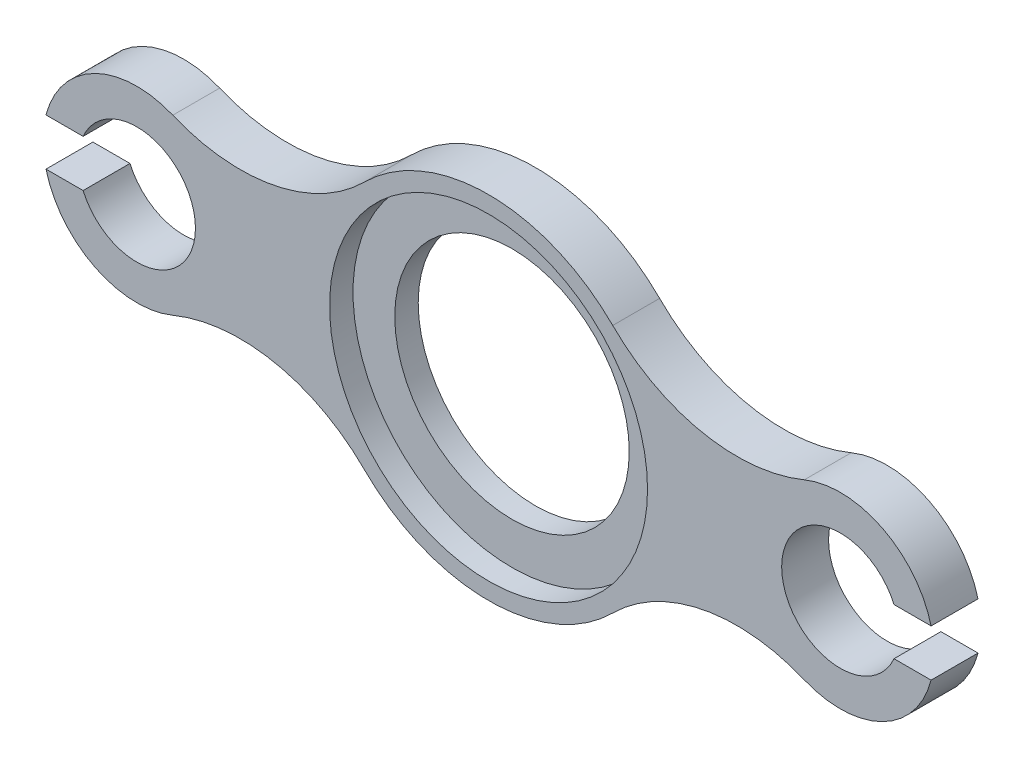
from build123d import *

# Parameters (mm, degrees)
ESQUISSE1_R             = 50
BOSS_EXTRU_1_DEPTH      = 20
ESQUISSE2_R             = 67.8
ENL_V_MAT_EXTRU_1_DEPTH = 10


with BuildPart() as part:
    # Esquisse1 → Boss.-Extru.1 (new body)
    with BuildSketch(Plane.XY):
        with BuildLine():
            Line((172.912878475, -10), (188.729833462, -10))
            ThreePointArc((188.729833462, -10), (167.842344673, -35.800149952), (134.666666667, -36.944402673))
            ThreePointArc((134.666666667, -36.944402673), (91.362529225, -32.640861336), (52.958333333, -53.107578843))
            ThreePointArc((52.958333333, -53.107578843), (0, -75), (-52.958333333, -53.107578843))
            ThreePointArc((-52.958333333, -53.107578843), (-91.362529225, -32.640861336), (-134.666666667, -36.944402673))
            ThreePointArc((-134.666666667, -36.944402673), (-167.842344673, -35.800149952), (-188.729833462, -10))
            Line((-188.729833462, -10), (-172.912878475, -10))
            ThreePointArc((-172.912878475, -10), (-125, 0), (-172.912878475, 10))
            Line((-172.912878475, 10), (-188.729833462, 10))
            ThreePointArc((-188.729833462, 10), (-167.842344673, 35.800149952), (-134.666666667, 36.944402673))
            ThreePointArc((-134.666666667, 36.944402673), (-91.362529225, 32.640861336), (-52.958333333, 53.107578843))
            ThreePointArc((-52.958333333, 53.107578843), (0, 75), (52.958333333, 53.107578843))
            ThreePointArc((52.958333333, 53.107578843), (91.362529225, 32.640861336), (134.666666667, 36.944402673))
            ThreePointArc((134.666666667, 36.944402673), (167.842344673, 35.800149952), (188.729833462, 10))
            Line((188.729833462, 10), (172.912878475, 10))
            ThreePointArc((172.912878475, 10), (125, 0), (172.912878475, -10))
        make_face()
        Circle(ESQUISSE1_R, mode=Mode.SUBTRACT)
    extrude(amount=BOSS_EXTRU_1_DEPTH)

    # Esquisse2 → Enl_v. mat.-Extru.1 (cut)
    with BuildSketch(Plane.XY.offset(20)):
        Circle(ESQUISSE2_R)
    extrude(amount=-ENL_V_MAT_EXTRU_1_DEPTH, mode=Mode.SUBTRACT)


solid = part.part
